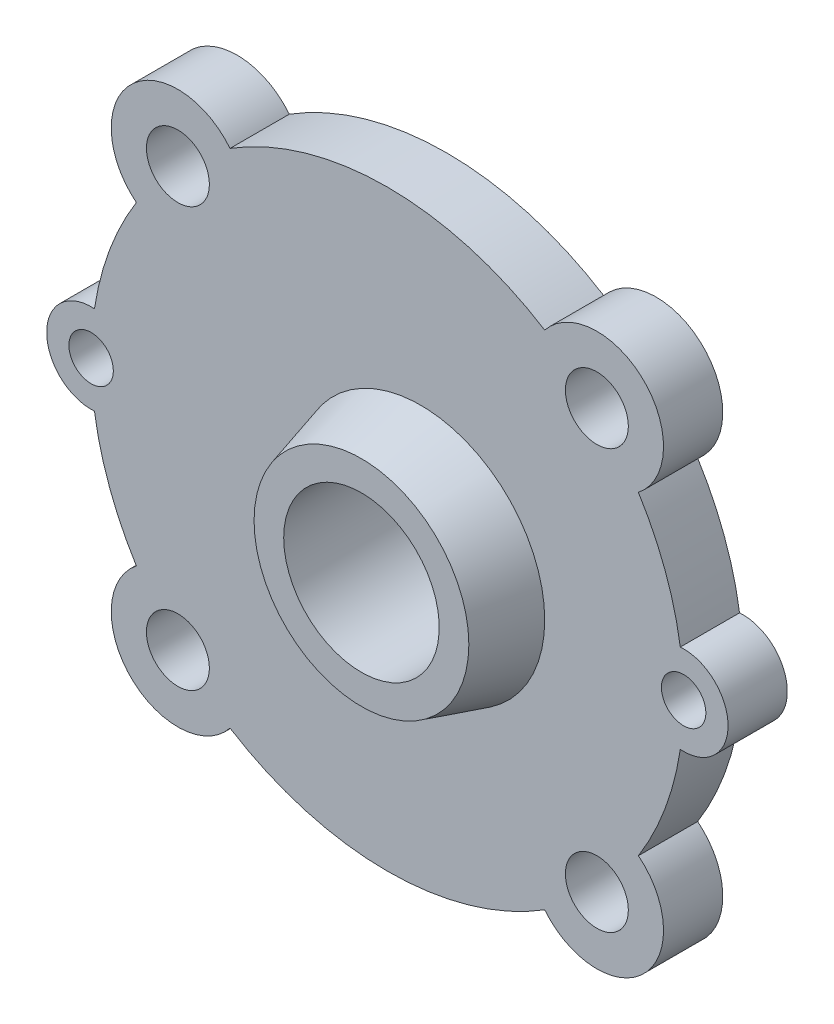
ISO-10303-21;
HEADER;
FILE_DESCRIPTION(('STEP AP214'),'2;1');
FILE_NAME('part.step','',(''),(''),'','','');
FILE_SCHEMA(('AUTOMOTIVE_DESIGN { 1 0 10303 214 1 1 1 1 }'));
ENDSEC;
DATA;
#1=APPLICATION_CONTEXT('core data for automotive mechanical design processes');
#2=APPLICATION_PROTOCOL_DEFINITION('international standard','automotive_design',2000,#1);
#3=PRODUCT_CONTEXT('',#1,'mechanical');
#4=PRODUCT('Part','Part','',(#3));
#5=PRODUCT_RELATED_PRODUCT_CATEGORY('part','',(#4));
#6=PRODUCT_DEFINITION_FORMATION('','',#4);
#7=PRODUCT_DEFINITION_CONTEXT('part definition',#1,'design');
#8=PRODUCT_DEFINITION('design','',#6,#7);
#9=PRODUCT_DEFINITION_SHAPE('','',#8);
#10=(LENGTH_UNIT() NAMED_UNIT(*) SI_UNIT(.MILLI.,.METRE.));
#11=(NAMED_UNIT(*) PLANE_ANGLE_UNIT() SI_UNIT($,.RADIAN.));
#12=(NAMED_UNIT(*) SI_UNIT($,.STERADIAN.) SOLID_ANGLE_UNIT());
#13=UNCERTAINTY_MEASURE_WITH_UNIT(LENGTH_MEASURE(1.E-05),#10,'distance_accuracy_value','');
#14=(GEOMETRIC_REPRESENTATION_CONTEXT(3) GLOBAL_UNCERTAINTY_ASSIGNED_CONTEXT((#13)) GLOBAL_UNIT_ASSIGNED_CONTEXT((#10,
#11,#12)) REPRESENTATION_CONTEXT('',''));
#15=CARTESIAN_POINT('',(0.,0.,0.));
#16=DIRECTION('',(0.,0.,1.));
#17=DIRECTION('',(1.,0.,0.));
#18=AXIS2_PLACEMENT_3D('',#15,#16,#17);
#19=CARTESIAN_POINT('',(14.1421356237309,14.142135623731,10.));
#20=DIRECTION('',(0.,0.,1.));
#21=DIRECTION('',(1.,0.,0.));
#22=AXIS2_PLACEMENT_3D('',#19,#20,#21);
#23=PLANE('',#22);
#24=CARTESIAN_POINT('',(0.,0.,10.));
#25=DIRECTION('',(0.,0.,1.));
#26=DIRECTION('',(1.,0.,0.));
#27=AXIS2_PLACEMENT_3D('',#24,#25,#26);
#28=CIRCLE('',#27,40.);
#29=CARTESIAN_POINT('',(39.55,5.98310120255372,10.));
#30=VERTEX_POINT('',#29);
#31=CARTESIAN_POINT('',(33.8918864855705,21.2447647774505,10.));
#32=VERTEX_POINT('',#31);
#33=EDGE_CURVE('E177',#30,#32,#28,.T.);
#34=ORIENTED_EDGE('',*,*,#33,.T.);
#35=CARTESIAN_POINT('',(28.2842712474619,28.284271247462,10.));
#36=DIRECTION('',(0.,0.,1.));
#37=DIRECTION('',(1.,0.,0.));
#38=AXIS2_PLACEMENT_3D('',#35,#36,#37);
#39=CIRCLE('',#38,9.00000000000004);
#40=CARTESIAN_POINT('',(21.2447647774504,33.8918864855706,10.));
#41=VERTEX_POINT('',#40);
#42=EDGE_CURVE('E105',#32,#41,#39,.T.);
#43=ORIENTED_EDGE('',*,*,#42,.T.);
#44=CARTESIAN_POINT('',(0.,0.,10.));
#45=DIRECTION('',(0.,0.,1.));
#46=DIRECTION('',(1.,0.,0.));
#47=AXIS2_PLACEMENT_3D('',#44,#45,#46);
#48=CIRCLE('',#47,40.);
#49=CARTESIAN_POINT('',(-21.2447647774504,33.8918864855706,10.));
#50=VERTEX_POINT('',#49);
#51=EDGE_CURVE('E204',#41,#50,#48,.T.);
#52=ORIENTED_EDGE('',*,*,#51,.T.);
#53=CARTESIAN_POINT('',(-28.2842712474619,28.2842712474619,10.));
#54=DIRECTION('',(0.,0.,1.));
#55=DIRECTION('',(1.,0.,0.));
#56=AXIS2_PLACEMENT_3D('',#53,#54,#55);
#57=CIRCLE('',#56,9.00000000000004);
#58=CARTESIAN_POINT('',(-33.8918864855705,21.2447647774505,10.));
#59=VERTEX_POINT('',#58);
#60=EDGE_CURVE('E223',#50,#59,#57,.T.);
#61=ORIENTED_EDGE('',*,*,#60,.T.);
#62=CARTESIAN_POINT('',(0.,0.,10.));
#63=DIRECTION('',(0.,0.,1.));
#64=DIRECTION('',(1.,0.,0.));
#65=AXIS2_PLACEMENT_3D('',#62,#63,#64);
#66=CIRCLE('',#65,40.);
#67=CARTESIAN_POINT('',(-39.55,5.98310120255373,10.));
#68=VERTEX_POINT('',#67);
#69=EDGE_CURVE('E220',#59,#68,#66,.T.);
#70=ORIENTED_EDGE('',*,*,#69,.T.);
#71=CARTESIAN_POINT('',(-39.9999999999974,0.,10.));
#72=DIRECTION('',(0.,0.,1.));
#73=DIRECTION('',(1.,0.,0.));
#74=AXIS2_PLACEMENT_3D('',#71,#72,#73);
#75=CIRCLE('',#74,5.9999999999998);
#76=CARTESIAN_POINT('',(-39.55,-5.98310120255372,10.));
#77=VERTEX_POINT('',#76);
#78=EDGE_CURVE('E222',#68,#77,#75,.T.);
#79=ORIENTED_EDGE('',*,*,#78,.T.);
#80=CARTESIAN_POINT('',(0.,0.,10.));
#81=DIRECTION('',(0.,0.,1.));
#82=DIRECTION('',(1.,0.,0.));
#83=AXIS2_PLACEMENT_3D('',#80,#81,#82);
#84=CIRCLE('',#83,40.);
#85=CARTESIAN_POINT('',(-33.8918864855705,-21.2447647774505,10.));
#86=VERTEX_POINT('',#85);
#87=EDGE_CURVE('E225',#77,#86,#84,.T.);
#88=ORIENTED_EDGE('',*,*,#87,.T.);
#89=CARTESIAN_POINT('',(-28.2842712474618,-28.284271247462,10.));
#90=DIRECTION('',(0.,0.,1.));
#91=DIRECTION('',(1.,0.,0.));
#92=AXIS2_PLACEMENT_3D('',#89,#90,#91);
#93=CIRCLE('',#92,9.00000000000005);
#94=CARTESIAN_POINT('',(-21.2447647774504,-33.8918864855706,10.));
#95=VERTEX_POINT('',#94);
#96=EDGE_CURVE('E231',#86,#95,#93,.T.);
#97=ORIENTED_EDGE('',*,*,#96,.T.);
#98=CARTESIAN_POINT('',(0.,0.,10.));
#99=DIRECTION('',(0.,0.,1.));
#100=DIRECTION('',(1.,0.,0.));
#101=AXIS2_PLACEMENT_3D('',#98,#99,#100);
#102=CIRCLE('',#101,40.);
#103=CARTESIAN_POINT('',(21.2447647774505,-33.8918864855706,10.));
#104=VERTEX_POINT('',#103);
#105=EDGE_CURVE('E136',#95,#104,#102,.T.);
#106=ORIENTED_EDGE('',*,*,#105,.T.);
#107=CARTESIAN_POINT('',(28.2842712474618,-28.284271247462,10.));
#108=DIRECTION('',(0.,0.,1.));
#109=DIRECTION('',(1.,0.,0.));
#110=AXIS2_PLACEMENT_3D('',#107,#108,#109);
#111=CIRCLE('',#110,8.99999999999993);
#112=CARTESIAN_POINT('',(33.8918864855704,-21.2447647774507,10.));
#113=VERTEX_POINT('',#112);
#114=EDGE_CURVE('E130',#104,#113,#111,.T.);
#115=ORIENTED_EDGE('',*,*,#114,.T.);
#116=CARTESIAN_POINT('',(0.,0.,10.));
#117=DIRECTION('',(0.,0.,1.));
#118=DIRECTION('',(1.,0.,0.));
#119=AXIS2_PLACEMENT_3D('',#116,#117,#118);
#120=CIRCLE('',#119,40.);
#121=CARTESIAN_POINT('',(39.55,-5.98310120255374,10.));
#122=VERTEX_POINT('',#121);
#123=EDGE_CURVE('E134',#113,#122,#120,.T.);
#124=ORIENTED_EDGE('',*,*,#123,.T.);
#125=CARTESIAN_POINT('',(39.9999999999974,0.,10.));
#126=DIRECTION('',(0.,0.,1.));
#127=DIRECTION('',(1.,0.,0.));
#128=AXIS2_PLACEMENT_3D('',#125,#126,#127);
#129=CIRCLE('',#128,5.99999999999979);
#130=EDGE_CURVE('E50',#122,#30,#129,.T.);
#131=ORIENTED_EDGE('',*,*,#130,.T.);
#132=EDGE_LOOP('',(#34,#43,#52,#61,#70,#79,#88,#97,#106,#115,#124,#131));
#133=FACE_BOUND('',#132,.T.);
#134=CARTESIAN_POINT('',(28.2842712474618,-28.284271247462,10.));
#135=DIRECTION('',(0.,0.,1.));
#136=DIRECTION('',(1.,0.,0.));
#137=AXIS2_PLACEMENT_3D('',#134,#135,#136);
#138=CIRCLE('',#137,4.24999999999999);
#139=CARTESIAN_POINT('',(32.5342712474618,-28.284271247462,10.));
#140=VERTEX_POINT('',#139);
#141=EDGE_CURVE('E341',#140,#140,#138,.T.);
#142=ORIENTED_EDGE('',*,*,#141,.F.);
#143=EDGE_LOOP('',(#142));
#144=FACE_BOUND('',#143,.T.);
#145=CARTESIAN_POINT('',(28.2842712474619,28.284271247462,10.));
#146=DIRECTION('',(0.,0.,1.));
#147=DIRECTION('',(1.,0.,0.));
#148=AXIS2_PLACEMENT_3D('',#145,#146,#147);
#149=CIRCLE('',#148,4.24999999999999);
#150=CARTESIAN_POINT('',(32.5342712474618,28.284271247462,10.));
#151=VERTEX_POINT('',#150);
#152=EDGE_CURVE('E335',#151,#151,#149,.T.);
#153=ORIENTED_EDGE('',*,*,#152,.F.);
#154=EDGE_LOOP('',(#153));
#155=FACE_BOUND('',#154,.T.);
#156=CARTESIAN_POINT('',(-28.2842712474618,-28.284271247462,10.));
#157=DIRECTION('',(0.,0.,1.));
#158=DIRECTION('',(1.,0.,0.));
#159=AXIS2_PLACEMENT_3D('',#156,#157,#158);
#160=CIRCLE('',#159,4.24999999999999);
#161=CARTESIAN_POINT('',(-24.0342712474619,-28.284271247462,10.));
#162=VERTEX_POINT('',#161);
#163=EDGE_CURVE('E329',#162,#162,#160,.T.);
#164=ORIENTED_EDGE('',*,*,#163,.F.);
#165=EDGE_LOOP('',(#164));
#166=FACE_BOUND('',#165,.T.);
#167=CARTESIAN_POINT('',(-28.2842712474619,28.2842712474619,10.));
#168=DIRECTION('',(0.,0.,1.));
#169=DIRECTION('',(1.,0.,0.));
#170=AXIS2_PLACEMENT_3D('',#167,#168,#169);
#171=CIRCLE('',#170,4.24999999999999);
#172=CARTESIAN_POINT('',(-24.0342712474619,28.2842712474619,10.));
#173=VERTEX_POINT('',#172);
#174=EDGE_CURVE('E321',#173,#173,#171,.T.);
#175=ORIENTED_EDGE('',*,*,#174,.F.);
#176=EDGE_LOOP('',(#175));
#177=FACE_BOUND('',#176,.T.);
#178=CARTESIAN_POINT('',(-39.9999999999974,0.,10.));
#179=DIRECTION('',(0.,0.,1.));
#180=DIRECTION('',(1.,0.,0.));
#181=AXIS2_PLACEMENT_3D('',#178,#179,#180);
#182=CIRCLE('',#181,3.);
#183=CARTESIAN_POINT('',(-36.9999999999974,0.,10.));
#184=VERTEX_POINT('',#183);
#185=EDGE_CURVE('E315',#184,#184,#182,.T.);
#186=ORIENTED_EDGE('',*,*,#185,.F.);
#187=EDGE_LOOP('',(#186));
#188=FACE_BOUND('',#187,.T.);
#189=CARTESIAN_POINT('',(39.9999999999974,0.,10.));
#190=DIRECTION('',(0.,0.,1.));
#191=DIRECTION('',(1.,0.,0.));
#192=AXIS2_PLACEMENT_3D('',#189,#190,#191);
#193=CIRCLE('',#192,3.);
#194=CARTESIAN_POINT('',(42.9999999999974,0.,10.));
#195=VERTEX_POINT('',#194);
#196=EDGE_CURVE('E311',#195,#195,#193,.T.);
#197=ORIENTED_EDGE('',*,*,#196,.F.);
#198=EDGE_LOOP('',(#197));
#199=FACE_BOUND('',#198,.T.);
#200=CARTESIAN_POINT('',(4.5,0.,9.99999999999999));
#201=DIRECTION('',(0.,0.,-1.));
#202=DIRECTION('',(-1.,0.,0.));
#203=AXIS2_PLACEMENT_3D('',#200,#201,#202);
#204=CIRCLE('',#203,16.7447647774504);
#205=CARTESIAN_POINT('',(-12.2447647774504,0.,9.99999999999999));
#206=VERTEX_POINT('',#205);
#207=EDGE_CURVE('E306',#206,#206,#204,.T.);
#208=ORIENTED_EDGE('',*,*,#207,.T.);
#209=EDGE_LOOP('',(#208));
#210=FACE_BOUND('',#209,.T.);
#211=ADVANCED_FACE('F33',(#133,#144,#155,#166,#177,#188,#199,#210),#23,.T.);
#212=CARTESIAN_POINT('',(14.1421356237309,14.142135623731,2.));
#213=DIRECTION('',(0.,0.,1.));
#214=DIRECTION('',(1.,0.,0.));
#215=AXIS2_PLACEMENT_3D('',#212,#213,#214);
#216=PLANE('',#215);
#217=CARTESIAN_POINT('',(39.9999999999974,0.,2.));
#218=DIRECTION('',(0.,0.,1.));
#219=DIRECTION('',(1.,0.,0.));
#220=AXIS2_PLACEMENT_3D('',#217,#218,#219);
#221=CIRCLE('',#220,3.);
#222=CARTESIAN_POINT('',(42.9999999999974,0.,2.));
#223=VERTEX_POINT('',#222);
#224=EDGE_CURVE('E312',#223,#223,#221,.T.);
#225=ORIENTED_EDGE('',*,*,#224,.T.);
#226=EDGE_LOOP('',(#225));
#227=FACE_BOUND('',#226,.T.);
#228=CARTESIAN_POINT('',(-39.9999999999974,0.,2.));
#229=DIRECTION('',(0.,0.,1.));
#230=DIRECTION('',(1.,0.,0.));
#231=AXIS2_PLACEMENT_3D('',#228,#229,#230);
#232=CIRCLE('',#231,3.);
#233=CARTESIAN_POINT('',(-36.9999999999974,0.,2.));
#234=VERTEX_POINT('',#233);
#235=EDGE_CURVE('E318',#234,#234,#232,.T.);
#236=ORIENTED_EDGE('',*,*,#235,.T.);
#237=EDGE_LOOP('',(#236));
#238=FACE_BOUND('',#237,.T.);
#239=CARTESIAN_POINT('',(-28.2842712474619,28.2842712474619,2.));
#240=DIRECTION('',(0.,0.,1.));
#241=DIRECTION('',(1.,0.,0.));
#242=AXIS2_PLACEMENT_3D('',#239,#240,#241);
#243=CIRCLE('',#242,4.25);
#244=CARTESIAN_POINT('',(-24.0342712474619,28.2842712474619,2.));
#245=VERTEX_POINT('',#244);
#246=EDGE_CURVE('E326',#245,#245,#243,.T.);
#247=ORIENTED_EDGE('',*,*,#246,.T.);
#248=EDGE_LOOP('',(#247));
#249=FACE_BOUND('',#248,.T.);
#250=CARTESIAN_POINT('',(-28.2842712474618,-28.284271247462,2.));
#251=DIRECTION('',(0.,0.,1.));
#252=DIRECTION('',(1.,0.,0.));
#253=AXIS2_PLACEMENT_3D('',#250,#251,#252);
#254=CIRCLE('',#253,4.25);
#255=CARTESIAN_POINT('',(-24.0342712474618,-28.284271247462,2.));
#256=VERTEX_POINT('',#255);
#257=EDGE_CURVE('E332',#256,#256,#254,.T.);
#258=ORIENTED_EDGE('',*,*,#257,.T.);
#259=EDGE_LOOP('',(#258));
#260=FACE_BOUND('',#259,.T.);
#261=CARTESIAN_POINT('',(28.2842712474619,28.284271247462,2.));
#262=DIRECTION('',(0.,0.,1.));
#263=DIRECTION('',(1.,0.,0.));
#264=AXIS2_PLACEMENT_3D('',#261,#262,#263);
#265=CIRCLE('',#264,4.25);
#266=CARTESIAN_POINT('',(32.5342712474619,28.284271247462,2.));
#267=VERTEX_POINT('',#266);
#268=EDGE_CURVE('E338',#267,#267,#265,.T.);
#269=ORIENTED_EDGE('',*,*,#268,.T.);
#270=EDGE_LOOP('',(#269));
#271=FACE_BOUND('',#270,.T.);
#272=CARTESIAN_POINT('',(28.2842712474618,-28.284271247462,2.));
#273=DIRECTION('',(0.,0.,1.));
#274=DIRECTION('',(1.,0.,0.));
#275=AXIS2_PLACEMENT_3D('',#272,#273,#274);
#276=CIRCLE('',#275,4.25);
#277=CARTESIAN_POINT('',(32.5342712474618,-28.284271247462,2.));
#278=VERTEX_POINT('',#277);
#279=EDGE_CURVE('E344',#278,#278,#276,.T.);
#280=ORIENTED_EDGE('',*,*,#279,.T.);
#281=EDGE_LOOP('',(#280));
#282=FACE_BOUND('',#281,.T.);
#283=CARTESIAN_POINT('',(0.,0.,2.));
#284=DIRECTION('',(0.,0.,1.));
#285=DIRECTION('',(1.,0.,0.));
#286=AXIS2_PLACEMENT_3D('',#283,#284,#285);
#287=CIRCLE('',#286,40.);
#288=CARTESIAN_POINT('',(39.55,5.98310120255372,2.));
#289=VERTEX_POINT('',#288);
#290=CARTESIAN_POINT('',(33.8918864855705,21.2447647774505,2.));
#291=VERTEX_POINT('',#290);
#292=EDGE_CURVE('E154',#289,#291,#287,.T.);
#293=ORIENTED_EDGE('',*,*,#292,.F.);
#294=CARTESIAN_POINT('',(39.9999999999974,0.,2.));
#295=DIRECTION('',(0.,0.,1.));
#296=DIRECTION('',(1.,0.,0.));
#297=AXIS2_PLACEMENT_3D('',#294,#295,#296);
#298=CIRCLE('',#297,5.99999999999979);
#299=CARTESIAN_POINT('',(39.55,-5.98310120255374,2.));
#300=VERTEX_POINT('',#299);
#301=EDGE_CURVE('E97',#300,#289,#298,.T.);
#302=ORIENTED_EDGE('',*,*,#301,.F.);
#303=CARTESIAN_POINT('',(0.,0.,2.));
#304=DIRECTION('',(0.,0.,1.));
#305=DIRECTION('',(1.,0.,0.));
#306=AXIS2_PLACEMENT_3D('',#303,#304,#305);
#307=CIRCLE('',#306,40.);
#308=CARTESIAN_POINT('',(33.8918864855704,-21.2447647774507,2.));
#309=VERTEX_POINT('',#308);
#310=EDGE_CURVE('E91',#309,#300,#307,.T.);
#311=ORIENTED_EDGE('',*,*,#310,.F.);
#312=CARTESIAN_POINT('',(28.2842712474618,-28.284271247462,2.));
#313=DIRECTION('',(0.,0.,1.));
#314=DIRECTION('',(1.,0.,0.));
#315=AXIS2_PLACEMENT_3D('',#312,#313,#314);
#316=CIRCLE('',#315,8.99999999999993);
#317=CARTESIAN_POINT('',(21.2447647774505,-33.8918864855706,2.));
#318=VERTEX_POINT('',#317);
#319=EDGE_CURVE('E144',#318,#309,#316,.T.);
#320=ORIENTED_EDGE('',*,*,#319,.F.);
#321=CARTESIAN_POINT('',(0.,0.,2.));
#322=DIRECTION('',(0.,0.,1.));
#323=DIRECTION('',(1.,0.,0.));
#324=AXIS2_PLACEMENT_3D('',#321,#322,#323);
#325=CIRCLE('',#324,40.);
#326=CARTESIAN_POINT('',(-21.2447647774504,-33.8918864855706,2.));
#327=VERTEX_POINT('',#326);
#328=EDGE_CURVE('E172',#327,#318,#325,.T.);
#329=ORIENTED_EDGE('',*,*,#328,.F.);
#330=CARTESIAN_POINT('',(-28.2842712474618,-28.284271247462,2.));
#331=DIRECTION('',(0.,0.,1.));
#332=DIRECTION('',(1.,0.,0.));
#333=AXIS2_PLACEMENT_3D('',#330,#331,#332);
#334=CIRCLE('',#333,9.00000000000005);
#335=CARTESIAN_POINT('',(-33.8918864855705,-21.2447647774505,2.));
#336=VERTEX_POINT('',#335);
#337=EDGE_CURVE('E170',#336,#327,#334,.T.);
#338=ORIENTED_EDGE('',*,*,#337,.F.);
#339=CARTESIAN_POINT('',(0.,0.,2.));
#340=DIRECTION('',(0.,0.,1.));
#341=DIRECTION('',(1.,0.,0.));
#342=AXIS2_PLACEMENT_3D('',#339,#340,#341);
#343=CIRCLE('',#342,40.);
#344=CARTESIAN_POINT('',(-39.55,-5.98310120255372,2.));
#345=VERTEX_POINT('',#344);
#346=EDGE_CURVE('E168',#345,#336,#343,.T.);
#347=ORIENTED_EDGE('',*,*,#346,.F.);
#348=CARTESIAN_POINT('',(-39.9999999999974,0.,2.));
#349=DIRECTION('',(0.,0.,1.));
#350=DIRECTION('',(1.,0.,0.));
#351=AXIS2_PLACEMENT_3D('',#348,#349,#350);
#352=CIRCLE('',#351,5.9999999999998);
#353=CARTESIAN_POINT('',(-39.55,5.98310120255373,2.));
#354=VERTEX_POINT('',#353);
#355=EDGE_CURVE('E166',#354,#345,#352,.T.);
#356=ORIENTED_EDGE('',*,*,#355,.F.);
#357=CARTESIAN_POINT('',(0.,0.,2.));
#358=DIRECTION('',(0.,0.,1.));
#359=DIRECTION('',(1.,0.,0.));
#360=AXIS2_PLACEMENT_3D('',#357,#358,#359);
#361=CIRCLE('',#360,40.);
#362=CARTESIAN_POINT('',(-33.8918864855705,21.2447647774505,2.));
#363=VERTEX_POINT('',#362);
#364=EDGE_CURVE('E164',#363,#354,#361,.T.);
#365=ORIENTED_EDGE('',*,*,#364,.F.);
#366=CARTESIAN_POINT('',(-28.2842712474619,28.2842712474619,2.));
#367=DIRECTION('',(0.,0.,1.));
#368=DIRECTION('',(1.,0.,0.));
#369=AXIS2_PLACEMENT_3D('',#366,#367,#368);
#370=CIRCLE('',#369,9.00000000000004);
#371=CARTESIAN_POINT('',(-21.2447647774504,33.8918864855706,2.));
#372=VERTEX_POINT('',#371);
#373=EDGE_CURVE('E162',#372,#363,#370,.T.);
#374=ORIENTED_EDGE('',*,*,#373,.F.);
#375=CARTESIAN_POINT('',(0.,0.,2.));
#376=DIRECTION('',(0.,0.,1.));
#377=DIRECTION('',(1.,0.,0.));
#378=AXIS2_PLACEMENT_3D('',#375,#376,#377);
#379=CIRCLE('',#378,40.);
#380=CARTESIAN_POINT('',(21.2447647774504,33.8918864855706,2.));
#381=VERTEX_POINT('',#380);
#382=EDGE_CURVE('E160',#381,#372,#379,.T.);
#383=ORIENTED_EDGE('',*,*,#382,.F.);
#384=CARTESIAN_POINT('',(28.2842712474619,28.284271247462,2.));
#385=DIRECTION('',(0.,0.,1.));
#386=DIRECTION('',(1.,0.,0.));
#387=AXIS2_PLACEMENT_3D('',#384,#385,#386);
#388=CIRCLE('',#387,9.00000000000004);
#389=EDGE_CURVE('E157',#291,#381,#388,.T.);
#390=ORIENTED_EDGE('',*,*,#389,.F.);
#391=EDGE_LOOP('',(#293,#302,#311,#320,#329,#338,#347,#356,#365,#374,#383,#390));
#392=FACE_BOUND('',#391,.T.);
#393=CARTESIAN_POINT('',(4.5,0.,2.));
#394=DIRECTION('',(0.,0.,1.));
#395=DIRECTION('',(1.,0.,0.));
#396=AXIS2_PLACEMENT_3D('',#393,#394,#395);
#397=CIRCLE('',#396,10.5);
#398=CARTESIAN_POINT('',(15.,0.,2.));
#399=VERTEX_POINT('',#398);
#400=EDGE_CURVE('E158',#399,#399,#397,.T.);
#401=ORIENTED_EDGE('',*,*,#400,.T.);
#402=EDGE_LOOP('',(#401));
#403=FACE_BOUND('',#402,.T.);
#404=ADVANCED_FACE('F208',(#227,#238,#249,#260,#271,#282,#392,#403),#216,.F.);
#405=CARTESIAN_POINT('',(0.,0.,10.));
#406=DIRECTION('',(0.,0.,-1.));
#407=DIRECTION('',(-1.,0.,0.));
#408=AXIS2_PLACEMENT_3D('',#405,#406,#407);
#409=CYLINDRICAL_SURFACE('',#408,40.);
#410=ORIENTED_EDGE('',*,*,#292,.T.);
#411=DIRECTION('',(0.,0.,-1.));
#412=VECTOR('',#411,1.);
#413=CARTESIAN_POINT('',(33.8918864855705,21.2447647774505,10.));
#414=LINE('',#413,#412);
#415=EDGE_CURVE('E12',#32,#291,#414,.T.);
#416=ORIENTED_EDGE('',*,*,#415,.F.);
#417=ORIENTED_EDGE('',*,*,#33,.F.);
#418=DIRECTION('',(0.,0.,-1.));
#419=VECTOR('',#418,1.);
#420=CARTESIAN_POINT('',(39.55,5.98310120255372,10.));
#421=LINE('',#420,#419);
#422=EDGE_CURVE('E150',#30,#289,#421,.T.);
#423=ORIENTED_EDGE('',*,*,#422,.T.);
#424=EDGE_LOOP('',(#410,#416,#417,#423));
#425=FACE_BOUND('',#424,.T.);
#426=ADVANCED_FACE('F35',(#425),#409,.T.);
#427=CARTESIAN_POINT('',(28.2842712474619,28.284271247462,10.));
#428=DIRECTION('',(0.,0.,-1.));
#429=DIRECTION('',(-1.,0.,0.));
#430=AXIS2_PLACEMENT_3D('',#427,#428,#429);
#431=CYLINDRICAL_SURFACE('',#430,9.00000000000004);
#432=ORIENTED_EDGE('',*,*,#389,.T.);
#433=DIRECTION('',(0.,0.,-1.));
#434=VECTOR('',#433,1.);
#435=CARTESIAN_POINT('',(21.2447647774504,33.8918864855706,10.));
#436=LINE('',#435,#434);
#437=EDGE_CURVE('E42',#41,#381,#436,.T.);
#438=ORIENTED_EDGE('',*,*,#437,.F.);
#439=ORIENTED_EDGE('',*,*,#42,.F.);
#440=ORIENTED_EDGE('',*,*,#415,.T.);
#441=EDGE_LOOP('',(#432,#438,#439,#440));
#442=FACE_BOUND('',#441,.T.);
#443=ADVANCED_FACE('F506',(#442),#431,.T.);
#444=CARTESIAN_POINT('',(0.,0.,10.));
#445=DIRECTION('',(0.,0.,-1.));
#446=DIRECTION('',(-1.,0.,0.));
#447=AXIS2_PLACEMENT_3D('',#444,#445,#446);
#448=CYLINDRICAL_SURFACE('',#447,40.);
#449=ORIENTED_EDGE('',*,*,#382,.T.);
#450=DIRECTION('',(0.,0.,-1.));
#451=VECTOR('',#450,1.);
#452=CARTESIAN_POINT('',(-21.2447647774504,33.8918864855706,10.));
#453=LINE('',#452,#451);
#454=EDGE_CURVE('E196',#50,#372,#453,.T.);
#455=ORIENTED_EDGE('',*,*,#454,.F.);
#456=ORIENTED_EDGE('',*,*,#51,.F.);
#457=ORIENTED_EDGE('',*,*,#437,.T.);
#458=EDGE_LOOP('',(#449,#455,#456,#457));
#459=FACE_BOUND('',#458,.T.);
#460=ADVANCED_FACE('F202',(#459),#448,.T.);
#461=CARTESIAN_POINT('',(-28.2842712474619,28.2842712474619,10.));
#462=DIRECTION('',(0.,0.,-1.));
#463=DIRECTION('',(-1.,0.,0.));
#464=AXIS2_PLACEMENT_3D('',#461,#462,#463);
#465=CYLINDRICAL_SURFACE('',#464,9.00000000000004);
#466=ORIENTED_EDGE('',*,*,#373,.T.);
#467=DIRECTION('',(0.,0.,-1.));
#468=VECTOR('',#467,1.);
#469=CARTESIAN_POINT('',(-33.8918864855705,21.2447647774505,10.));
#470=LINE('',#469,#468);
#471=EDGE_CURVE('E193',#59,#363,#470,.T.);
#472=ORIENTED_EDGE('',*,*,#471,.F.);
#473=ORIENTED_EDGE('',*,*,#60,.F.);
#474=ORIENTED_EDGE('',*,*,#454,.T.);
#475=EDGE_LOOP('',(#466,#472,#473,#474));
#476=FACE_BOUND('',#475,.T.);
#477=ADVANCED_FACE('F214',(#476),#465,.T.);
#478=CARTESIAN_POINT('',(0.,0.,10.));
#479=DIRECTION('',(0.,0.,-1.));
#480=DIRECTION('',(-1.,0.,0.));
#481=AXIS2_PLACEMENT_3D('',#478,#479,#480);
#482=CYLINDRICAL_SURFACE('',#481,40.);
#483=ORIENTED_EDGE('',*,*,#364,.T.);
#484=DIRECTION('',(0.,0.,-1.));
#485=VECTOR('',#484,1.);
#486=CARTESIAN_POINT('',(-39.55,5.98310120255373,10.));
#487=LINE('',#486,#485);
#488=EDGE_CURVE('E190',#68,#354,#487,.T.);
#489=ORIENTED_EDGE('',*,*,#488,.F.);
#490=ORIENTED_EDGE('',*,*,#69,.F.);
#491=ORIENTED_EDGE('',*,*,#471,.T.);
#492=EDGE_LOOP('',(#483,#489,#490,#491));
#493=FACE_BOUND('',#492,.T.);
#494=ADVANCED_FACE('F218',(#493),#482,.T.);
#495=CARTESIAN_POINT('',(-39.9999999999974,0.,10.));
#496=DIRECTION('',(0.,0.,-1.));
#497=DIRECTION('',(-1.,0.,0.));
#498=AXIS2_PLACEMENT_3D('',#495,#496,#497);
#499=CYLINDRICAL_SURFACE('',#498,5.9999999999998);
#500=ORIENTED_EDGE('',*,*,#355,.T.);
#501=DIRECTION('',(0.,0.,-1.));
#502=VECTOR('',#501,1.);
#503=CARTESIAN_POINT('',(-39.55,-5.98310120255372,10.));
#504=LINE('',#503,#502);
#505=EDGE_CURVE('E187',#77,#345,#504,.T.);
#506=ORIENTED_EDGE('',*,*,#505,.F.);
#507=ORIENTED_EDGE('',*,*,#78,.F.);
#508=ORIENTED_EDGE('',*,*,#488,.T.);
#509=EDGE_LOOP('',(#500,#506,#507,#508));
#510=FACE_BOUND('',#509,.T.);
#511=ADVANCED_FACE('F475',(#510),#499,.T.);
#512=CARTESIAN_POINT('',(0.,0.,10.));
#513=DIRECTION('',(0.,0.,-1.));
#514=DIRECTION('',(-1.,0.,0.));
#515=AXIS2_PLACEMENT_3D('',#512,#513,#514);
#516=CYLINDRICAL_SURFACE('',#515,40.);
#517=ORIENTED_EDGE('',*,*,#346,.T.);
#518=DIRECTION('',(0.,0.,-1.));
#519=VECTOR('',#518,1.);
#520=CARTESIAN_POINT('',(-33.8918864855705,-21.2447647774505,10.));
#521=LINE('',#520,#519);
#522=EDGE_CURVE('E184',#86,#336,#521,.T.);
#523=ORIENTED_EDGE('',*,*,#522,.F.);
#524=ORIENTED_EDGE('',*,*,#87,.F.);
#525=ORIENTED_EDGE('',*,*,#505,.T.);
#526=EDGE_LOOP('',(#517,#523,#524,#525));
#527=FACE_BOUND('',#526,.T.);
#528=ADVANCED_FACE('F467',(#527),#516,.T.);
#529=CARTESIAN_POINT('',(-28.2842712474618,-28.284271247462,10.));
#530=DIRECTION('',(0.,0.,-1.));
#531=DIRECTION('',(-1.,0.,0.));
#532=AXIS2_PLACEMENT_3D('',#529,#530,#531);
#533=CYLINDRICAL_SURFACE('',#532,9.00000000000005);
#534=ORIENTED_EDGE('',*,*,#337,.T.);
#535=DIRECTION('',(0.,0.,-1.));
#536=VECTOR('',#535,1.);
#537=CARTESIAN_POINT('',(-21.2447647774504,-33.8918864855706,10.));
#538=LINE('',#537,#536);
#539=EDGE_CURVE('E181',#95,#327,#538,.T.);
#540=ORIENTED_EDGE('',*,*,#539,.F.);
#541=ORIENTED_EDGE('',*,*,#96,.F.);
#542=ORIENTED_EDGE('',*,*,#522,.T.);
#543=EDGE_LOOP('',(#534,#540,#541,#542));
#544=FACE_BOUND('',#543,.T.);
#545=ADVANCED_FACE('F237',(#544),#533,.T.);
#546=CARTESIAN_POINT('',(0.,0.,10.));
#547=DIRECTION('',(0.,0.,-1.));
#548=DIRECTION('',(-1.,0.,0.));
#549=AXIS2_PLACEMENT_3D('',#546,#547,#548);
#550=CYLINDRICAL_SURFACE('',#549,40.);
#551=ORIENTED_EDGE('',*,*,#328,.T.);
#552=DIRECTION('',(0.,0.,-1.));
#553=VECTOR('',#552,1.);
#554=CARTESIAN_POINT('',(21.2447647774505,-33.8918864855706,10.));
#555=LINE('',#554,#553);
#556=EDGE_CURVE('E145',#104,#318,#555,.T.);
#557=ORIENTED_EDGE('',*,*,#556,.F.);
#558=ORIENTED_EDGE('',*,*,#105,.F.);
#559=ORIENTED_EDGE('',*,*,#539,.T.);
#560=EDGE_LOOP('',(#551,#557,#558,#559));
#561=FACE_BOUND('',#560,.T.);
#562=ADVANCED_FACE('F241',(#561),#550,.T.);
#563=CARTESIAN_POINT('',(28.2842712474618,-28.284271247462,10.));
#564=DIRECTION('',(0.,0.,-1.));
#565=DIRECTION('',(-1.,0.,0.));
#566=AXIS2_PLACEMENT_3D('',#563,#564,#565);
#567=CYLINDRICAL_SURFACE('',#566,8.99999999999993);
#568=ORIENTED_EDGE('',*,*,#319,.T.);
#569=DIRECTION('',(0.,0.,-1.));
#570=VECTOR('',#569,1.);
#571=CARTESIAN_POINT('',(33.8918864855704,-21.2447647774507,10.));
#572=LINE('',#571,#570);
#573=EDGE_CURVE('E141',#113,#309,#572,.T.);
#574=ORIENTED_EDGE('',*,*,#573,.F.);
#575=ORIENTED_EDGE('',*,*,#114,.F.);
#576=ORIENTED_EDGE('',*,*,#556,.T.);
#577=EDGE_LOOP('',(#568,#574,#575,#576));
#578=FACE_BOUND('',#577,.T.);
#579=ADVANCED_FACE('F142',(#578),#567,.T.);
#580=CARTESIAN_POINT('',(0.,0.,10.));
#581=DIRECTION('',(0.,0.,-1.));
#582=DIRECTION('',(-1.,0.,0.));
#583=AXIS2_PLACEMENT_3D('',#580,#581,#582);
#584=CYLINDRICAL_SURFACE('',#583,40.);
#585=ORIENTED_EDGE('',*,*,#310,.T.);
#586=DIRECTION('',(0.,0.,-1.));
#587=VECTOR('',#586,1.);
#588=CARTESIAN_POINT('',(39.55,-5.98310120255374,10.));
#589=LINE('',#588,#587);
#590=EDGE_CURVE('E146',#122,#300,#589,.T.);
#591=ORIENTED_EDGE('',*,*,#590,.F.);
#592=ORIENTED_EDGE('',*,*,#123,.F.);
#593=ORIENTED_EDGE('',*,*,#573,.T.);
#594=EDGE_LOOP('',(#585,#591,#592,#593));
#595=FACE_BOUND('',#594,.T.);
#596=ADVANCED_FACE('F148',(#595),#584,.T.);
#597=CARTESIAN_POINT('',(39.9999999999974,0.,10.));
#598=DIRECTION('',(0.,0.,-1.));
#599=DIRECTION('',(-1.,0.,0.));
#600=AXIS2_PLACEMENT_3D('',#597,#598,#599);
#601=CYLINDRICAL_SURFACE('',#600,5.99999999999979);
#602=ORIENTED_EDGE('',*,*,#301,.T.);
#603=ORIENTED_EDGE('',*,*,#422,.F.);
#604=ORIENTED_EDGE('',*,*,#130,.F.);
#605=ORIENTED_EDGE('',*,*,#590,.T.);
#606=EDGE_LOOP('',(#602,#603,#604,#605));
#607=FACE_BOUND('',#606,.T.);
#608=ADVANCED_FACE('F245',(#607),#601,.T.);
#609=CARTESIAN_POINT('',(4.5,0.,10.));
#610=DIRECTION('',(0.,0.,-1.));
#611=DIRECTION('',(-1.,0.,0.));
#612=AXIS2_PLACEMENT_3D('',#609,#610,#611);
#613=CYLINDRICAL_SURFACE('',#612,10.5);
#614=ORIENTED_EDGE('',*,*,#400,.F.);
#615=EDGE_LOOP('',(#614));
#616=FACE_BOUND('',#615,.T.);
#617=CARTESIAN_POINT('',(4.5,0.,18.));
#618=DIRECTION('',(0.,0.,-1.));
#619=DIRECTION('',(-1.,0.,0.));
#620=AXIS2_PLACEMENT_3D('',#617,#618,#619);
#621=CIRCLE('',#620,10.5);
#622=CARTESIAN_POINT('',(-5.99999999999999,0.,18.));
#623=VERTEX_POINT('',#622);
#624=EDGE_CURVE('E303',#623,#623,#621,.T.);
#625=ORIENTED_EDGE('',*,*,#624,.F.);
#626=EDGE_LOOP('',(#625));
#627=FACE_BOUND('',#626,.T.);
#628=ADVANCED_FACE('F247',(#616,#627),#613,.F.);
#629=CARTESIAN_POINT('',(28.2842712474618,-28.284271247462,10.));
#630=DIRECTION('',(0.,0.,1.));
#631=DIRECTION('',(1.,0.,0.));
#632=AXIS2_PLACEMENT_3D('',#629,#630,#631);
#633=CYLINDRICAL_SURFACE('',#632,4.24999999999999);
#634=ORIENTED_EDGE('',*,*,#279,.F.);
#635=EDGE_LOOP('',(#634));
#636=FACE_BOUND('',#635,.T.);
#637=ORIENTED_EDGE('',*,*,#141,.T.);
#638=EDGE_LOOP('',(#637));
#639=FACE_BOUND('',#638,.T.);
#640=ADVANCED_FACE('F253',(#636,#639),#633,.F.);
#641=CARTESIAN_POINT('',(28.2842712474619,28.284271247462,10.));
#642=DIRECTION('',(0.,0.,1.));
#643=DIRECTION('',(1.,0.,0.));
#644=AXIS2_PLACEMENT_3D('',#641,#642,#643);
#645=CYLINDRICAL_SURFACE('',#644,4.25);
#646=ORIENTED_EDGE('',*,*,#268,.F.);
#647=EDGE_LOOP('',(#646));
#648=FACE_BOUND('',#647,.T.);
#649=ORIENTED_EDGE('',*,*,#152,.T.);
#650=EDGE_LOOP('',(#649));
#651=FACE_BOUND('',#650,.T.);
#652=ADVANCED_FACE('F267',(#648,#651),#645,.F.);
#653=CARTESIAN_POINT('',(-28.2842712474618,-28.284271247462,10.));
#654=DIRECTION('',(0.,0.,1.));
#655=DIRECTION('',(1.,0.,0.));
#656=AXIS2_PLACEMENT_3D('',#653,#654,#655);
#657=CYLINDRICAL_SURFACE('',#656,4.24999999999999);
#658=ORIENTED_EDGE('',*,*,#257,.F.);
#659=EDGE_LOOP('',(#658));
#660=FACE_BOUND('',#659,.T.);
#661=ORIENTED_EDGE('',*,*,#163,.T.);
#662=EDGE_LOOP('',(#661));
#663=FACE_BOUND('',#662,.T.);
#664=ADVANCED_FACE('F271',(#660,#663),#657,.F.);
#665=CARTESIAN_POINT('',(-28.2842712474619,28.2842712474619,10.));
#666=DIRECTION('',(0.,0.,1.));
#667=DIRECTION('',(1.,0.,0.));
#668=AXIS2_PLACEMENT_3D('',#665,#666,#667);
#669=CYLINDRICAL_SURFACE('',#668,4.24999999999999);
#670=ORIENTED_EDGE('',*,*,#246,.F.);
#671=EDGE_LOOP('',(#670));
#672=FACE_BOUND('',#671,.T.);
#673=ORIENTED_EDGE('',*,*,#174,.T.);
#674=EDGE_LOOP('',(#673));
#675=FACE_BOUND('',#674,.T.);
#676=ADVANCED_FACE('F275',(#672,#675),#669,.F.);
#677=CARTESIAN_POINT('',(-39.9999999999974,0.,2.));
#678=DIRECTION('',(0.,0.,1.));
#679=DIRECTION('',(1.,0.,0.));
#680=AXIS2_PLACEMENT_3D('',#677,#678,#679);
#681=CYLINDRICAL_SURFACE('',#680,3.);
#682=ORIENTED_EDGE('',*,*,#235,.F.);
#683=EDGE_LOOP('',(#682));
#684=FACE_BOUND('',#683,.T.);
#685=ORIENTED_EDGE('',*,*,#185,.T.);
#686=EDGE_LOOP('',(#685));
#687=FACE_BOUND('',#686,.T.);
#688=ADVANCED_FACE('F279',(#684,#687),#681,.F.);
#689=CARTESIAN_POINT('',(39.9999999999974,0.,2.));
#690=DIRECTION('',(0.,0.,1.));
#691=DIRECTION('',(1.,0.,0.));
#692=AXIS2_PLACEMENT_3D('',#689,#690,#691);
#693=CYLINDRICAL_SURFACE('',#692,3.);
#694=ORIENTED_EDGE('',*,*,#224,.F.);
#695=EDGE_LOOP('',(#694));
#696=FACE_BOUND('',#695,.T.);
#697=ORIENTED_EDGE('',*,*,#196,.T.);
#698=EDGE_LOOP('',(#697));
#699=FACE_BOUND('',#698,.T.);
#700=ADVANCED_FACE('F283',(#696,#699),#693,.F.);
#701=CARTESIAN_POINT('',(4.5,0.,18.));
#702=DIRECTION('',(0.,0.,-1.));
#703=DIRECTION('',(-1.,0.,0.));
#704=AXIS2_PLACEMENT_3D('',#701,#702,#703);
#705=CONICAL_SURFACE('',#704,14.5,0.273560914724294);
#706=ORIENTED_EDGE('',*,*,#207,.F.);
#707=EDGE_LOOP('',(#706));
#708=FACE_BOUND('',#707,.T.);
#709=CARTESIAN_POINT('',(4.5,0.,18.));
#710=DIRECTION('',(0.,0.,-1.));
#711=DIRECTION('',(-1.,0.,0.));
#712=AXIS2_PLACEMENT_3D('',#709,#710,#711);
#713=CIRCLE('',#712,14.5);
#714=CARTESIAN_POINT('',(-9.99999999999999,0.,18.));
#715=VERTEX_POINT('',#714);
#716=EDGE_CURVE('E300',#715,#715,#713,.T.);
#717=ORIENTED_EDGE('',*,*,#716,.T.);
#718=EDGE_LOOP('',(#717));
#719=FACE_BOUND('',#718,.T.);
#720=ADVANCED_FACE('F287',(#708,#719),#705,.T.);
#721=CARTESIAN_POINT('',(15.,0.,18.));
#722=DIRECTION('',(0.,0.,-1.));
#723=DIRECTION('',(-1.,0.,0.));
#724=AXIS2_PLACEMENT_3D('',#721,#722,#723);
#725=PLANE('',#724);
#726=ORIENTED_EDGE('',*,*,#716,.F.);
#727=EDGE_LOOP('',(#726));
#728=FACE_BOUND('',#727,.T.);
#729=ORIENTED_EDGE('',*,*,#624,.T.);
#730=EDGE_LOOP('',(#729));
#731=FACE_BOUND('',#730,.T.);
#732=ADVANCED_FACE('F291',(#728,#731),#725,.F.);
#733=CLOSED_SHELL('',(#211,#404,#426,#443,#460,#477,#494,#511,#528,#545,#562,#579,#596,#608,
#628,#640,#652,#664,#676,#688,#700,#720,#732));
#734=MANIFOLD_SOLID_BREP('B2',#733);
#735=ADVANCED_BREP_SHAPE_REPRESENTATION('',(#18,#734),#14);
#736=SHAPE_DEFINITION_REPRESENTATION(#9,#735);
ENDSEC;
END-ISO-10303-21;
